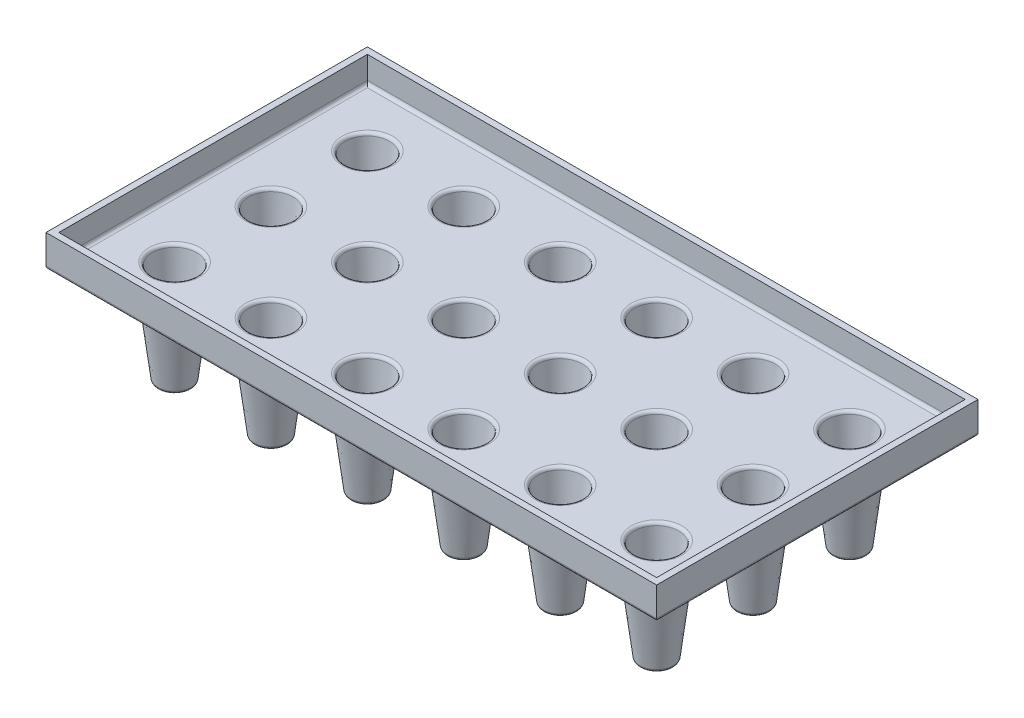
from build123d import *

# Parameters (mm, degrees)
SKETCH1_W                  = 241.3
SKETCH1_H                  = 127
BOSS_EXTRUDE1_DEPTH        = 12.7
SKETCH2_R                  = 12.7
BOSS_EXTRUDE2_DEPTH        = 50.8
BOSS_EXTRUDE2_DRAFT        = -7
LPATTERN1_COPY_1_SKETCH_R  = 12.7
LPATTERN1_COPY_1_DEPTH     = 50.8
LPATTERN1_COPY_1_DRAFT     = -7
LPATTERN1_COPY_2_SKETCH_R  = 12.7
LPATTERN1_COPY_2_DEPTH     = 50.8
LPATTERN1_COPY_2_DRAFT     = -7
LPATTERN1_COPY_3_SKETCH_R  = 12.7
LPATTERN1_COPY_3_DEPTH     = 50.8
LPATTERN1_COPY_3_DRAFT     = -7
LPATTERN1_COPY_4_SKETCH_R  = 12.7
LPATTERN1_COPY_4_DEPTH     = 50.8
LPATTERN1_COPY_4_DRAFT     = -7
LPATTERN1_COPY_5_SKETCH_R  = 12.7
LPATTERN1_COPY_5_DEPTH     = 50.8
LPATTERN1_COPY_5_DRAFT     = -7
LPATTERN1_COPY_6_SKETCH_R  = 12.7
LPATTERN1_COPY_6_DEPTH     = 50.8
LPATTERN1_COPY_6_DRAFT     = -7
LPATTERN1_COPY_7_SKETCH_R  = 12.7
LPATTERN1_COPY_7_DEPTH     = 50.8
LPATTERN1_COPY_7_DRAFT     = -7
LPATTERN1_COPY_8_SKETCH_R  = 12.7
LPATTERN1_COPY_8_DEPTH     = 50.8
LPATTERN1_COPY_8_DRAFT     = -7
LPATTERN1_COPY_9_SKETCH_R  = 12.7
LPATTERN1_COPY_9_DEPTH     = 50.8
LPATTERN1_COPY_9_DRAFT     = -7
LPATTERN1_COPY_10_SKETCH_R = 12.7
LPATTERN1_COPY_10_DEPTH    = 50.8
LPATTERN1_COPY_10_DRAFT    = -7
LPATTERN1_COPY_11_SKETCH_R = 12.7
LPATTERN1_COPY_11_DEPTH    = 50.8
LPATTERN1_COPY_11_DRAFT    = -7
LPATTERN1_COPY_12_SKETCH_R = 12.7
LPATTERN1_COPY_12_DEPTH    = 50.8
LPATTERN1_COPY_12_DRAFT    = -7
LPATTERN1_COPY_13_SKETCH_R = 12.7
LPATTERN1_COPY_13_DEPTH    = 50.8
LPATTERN1_COPY_13_DRAFT    = -7
LPATTERN1_COPY_14_SKETCH_R = 12.7
LPATTERN1_COPY_14_DEPTH    = 50.8
LPATTERN1_COPY_14_DRAFT    = -7
LPATTERN1_COPY_15_SKETCH_R = 12.7
LPATTERN1_COPY_15_DEPTH    = 50.8
LPATTERN1_COPY_15_DRAFT    = -7
LPATTERN1_COPY_16_SKETCH_R = 12.7
LPATTERN1_COPY_16_DEPTH    = 50.8
LPATTERN1_COPY_16_DRAFT    = -7
LPATTERN1_COPY_17_SKETCH_R = 12.7
LPATTERN1_COPY_17_DEPTH    = 50.8
LPATTERN1_COPY_17_DRAFT    = -7
SHELL1_T                   = -2.54
FILLET1_R                  = 1.27


with BuildPart() as part:
    # Sketch1 → Boss-Extrude1 (new body)
    with BuildSketch(Plane(origin=(0, 0, 0), x_dir=(1, 0, 0), z_dir=(0, 1, 0))):
        with Locations((120.65, 63.5)):
            Rectangle(SKETCH1_W, SKETCH1_H)
    extrude(amount=BOSS_EXTRUDE1_DEPTH)


with BuildPart() as boss_extrude2_tool:
    # Sketch2 → Boss-Extrude2 (with draft: the straight prism first)
    with BuildSketch(Plane(origin=(0, 12.7, 0), x_dir=(1, 0, 0), z_dir=(0, 1, 0))):
        with Locations((25.4, 25.4)):
            Circle(SKETCH2_R)
    extrude(amount=-BOSS_EXTRUDE2_DEPTH)
    # Boss-Extrude2: the draft: its side faces are tilted about the plane it starts from
    boss_extrude2_sides = [boss_extrude2_tool.faces().sort_by_distance(p)[0] for p in [
        (12.7, -12.7, -25.4),
    ]]
    draft(boss_extrude2_sides, Plane(origin=(0, 12.7, 0), x_dir=(1, 0, 0), z_dir=(0, 1, 0)), BOSS_EXTRUDE2_DRAFT)


with BuildPart() as part_1:
    add(part.part)

    # Boss-Extrude2: add boss_extrude2_tool
    add(boss_extrude2_tool.part)


with BuildPart() as lpattern1_copy_1_tool:
    # LPattern1 copy 1 sketch → LPattern1 copy 1 (with draft: the straight prism first)
    with BuildSketch(Plane(origin=(0, 12.7, -38.1), x_dir=(1, 0, 0), z_dir=(0, 1, 0))):
        with Locations((25.4, 25.4)):
            Circle(LPATTERN1_COPY_1_SKETCH_R)
    extrude(amount=-LPATTERN1_COPY_1_DEPTH)
    # LPattern1 copy 1: the draft: its side faces are tilted about the plane it starts from
    lpattern1_copy_1_sides = [lpattern1_copy_1_tool.faces().sort_by_distance(p)[0] for p in [
        (12.7, -12.7, -63.5),
    ]]
    draft(lpattern1_copy_1_sides, Plane(origin=(0, 12.7, -38.1), x_dir=(1, 0, 0), z_dir=(0, 1, 0)), LPATTERN1_COPY_1_DRAFT)


with BuildPart() as part_2:
    add(part_1.part)

    # LPattern1 copy 1: add lpattern1_copy_1_tool
    add(lpattern1_copy_1_tool.part)


with BuildPart() as lpattern1_copy_2_tool:
    # LPattern1 copy 2 sketch → LPattern1 copy 2 (with draft: the straight prism first)
    with BuildSketch(Plane(origin=(0, 12.7, -76.2), x_dir=(1, 0, 0), z_dir=(0, 1, 0))):
        with Locations((25.4, 25.4)):
            Circle(LPATTERN1_COPY_2_SKETCH_R)
    extrude(amount=-LPATTERN1_COPY_2_DEPTH)
    # LPattern1 copy 2: the draft: its side faces are tilted about the plane it starts from
    lpattern1_copy_2_sides = [lpattern1_copy_2_tool.faces().sort_by_distance(p)[0] for p in [
        (12.7, -12.7, -101.6),
    ]]
    draft(lpattern1_copy_2_sides, Plane(origin=(0, 12.7, -76.2), x_dir=(1, 0, 0), z_dir=(0, 1, 0)), LPATTERN1_COPY_2_DRAFT)


with BuildPart() as part_3:
    add(part_2.part)

    # LPattern1 copy 2: add lpattern1_copy_2_tool
    add(lpattern1_copy_2_tool.part)


with BuildPart() as lpattern1_copy_3_tool:
    # LPattern1 copy 3 sketch → LPattern1 copy 3 (with draft: the straight prism first)
    with BuildSketch(Plane(origin=(38.1, 12.7, 0), x_dir=(1, 0, 0), z_dir=(0, 1, 0))):
        with Locations((25.4, 25.4)):
            Circle(LPATTERN1_COPY_3_SKETCH_R)
    extrude(amount=-LPATTERN1_COPY_3_DEPTH)
    # LPattern1 copy 3: the draft: its side faces are tilted about the plane it starts from
    lpattern1_copy_3_sides = [lpattern1_copy_3_tool.faces().sort_by_distance(p)[0] for p in [
        (50.8, -12.7, -25.4),
    ]]
    draft(lpattern1_copy_3_sides, Plane(origin=(38.1, 12.7, 0), x_dir=(1, 0, 0), z_dir=(0, 1, 0)), LPATTERN1_COPY_3_DRAFT)


with BuildPart() as part_4:
    add(part_3.part)

    # LPattern1 copy 3: add lpattern1_copy_3_tool
    add(lpattern1_copy_3_tool.part)


with BuildPart() as lpattern1_copy_4_tool:
    # LPattern1 copy 4 sketch → LPattern1 copy 4 (with draft: the straight prism first)
    with BuildSketch(Plane(origin=(38.1, 12.7, -38.1), x_dir=(1, 0, 0), z_dir=(0, 1, 0))):
        with Locations((25.4, 25.4)):
            Circle(LPATTERN1_COPY_4_SKETCH_R)
    extrude(amount=-LPATTERN1_COPY_4_DEPTH)
    # LPattern1 copy 4: the draft: its side faces are tilted about the plane it starts from
    lpattern1_copy_4_sides = [lpattern1_copy_4_tool.faces().sort_by_distance(p)[0] for p in [
        (50.8, -12.7, -63.5),
    ]]
    draft(lpattern1_copy_4_sides, Plane(origin=(38.1, 12.7, -38.1), x_dir=(1, 0, 0), z_dir=(0, 1, 0)), LPATTERN1_COPY_4_DRAFT)


with BuildPart() as part_5:
    add(part_4.part)

    # LPattern1 copy 4: add lpattern1_copy_4_tool
    add(lpattern1_copy_4_tool.part)


with BuildPart() as lpattern1_copy_5_tool:
    # LPattern1 copy 5 sketch → LPattern1 copy 5 (with draft: the straight prism first)
    with BuildSketch(Plane(origin=(38.1, 12.7, -76.2), x_dir=(1, 0, 0), z_dir=(0, 1, 0))):
        with Locations((25.4, 25.4)):
            Circle(LPATTERN1_COPY_5_SKETCH_R)
    extrude(amount=-LPATTERN1_COPY_5_DEPTH)
    # LPattern1 copy 5: the draft: its side faces are tilted about the plane it starts from
    lpattern1_copy_5_sides = [lpattern1_copy_5_tool.faces().sort_by_distance(p)[0] for p in [
        (50.8, -12.7, -101.6),
    ]]
    draft(lpattern1_copy_5_sides, Plane(origin=(38.1, 12.7, -76.2), x_dir=(1, 0, 0), z_dir=(0, 1, 0)), LPATTERN1_COPY_5_DRAFT)


with BuildPart() as part_6:
    add(part_5.part)

    # LPattern1 copy 5: add lpattern1_copy_5_tool
    add(lpattern1_copy_5_tool.part)


with BuildPart() as lpattern1_copy_6_tool:
    # LPattern1 copy 6 sketch → LPattern1 copy 6 (with draft: the straight prism first)
    with BuildSketch(Plane(origin=(76.2, 12.7, 0), x_dir=(1, 0, 0), z_dir=(0, 1, 0))):
        with Locations((25.4, 25.4)):
            Circle(LPATTERN1_COPY_6_SKETCH_R)
    extrude(amount=-LPATTERN1_COPY_6_DEPTH)
    # LPattern1 copy 6: the draft: its side faces are tilted about the plane it starts from
    lpattern1_copy_6_sides = [lpattern1_copy_6_tool.faces().sort_by_distance(p)[0] for p in [
        (88.9, -12.7, -25.4),
    ]]
    draft(lpattern1_copy_6_sides, Plane(origin=(76.2, 12.7, 0), x_dir=(1, 0, 0), z_dir=(0, 1, 0)), LPATTERN1_COPY_6_DRAFT)


with BuildPart() as part_7:
    add(part_6.part)

    # LPattern1 copy 6: add lpattern1_copy_6_tool
    add(lpattern1_copy_6_tool.part)


with BuildPart() as lpattern1_copy_7_tool:
    # LPattern1 copy 7 sketch → LPattern1 copy 7 (with draft: the straight prism first)
    with BuildSketch(Plane(origin=(76.2, 12.7, -38.1), x_dir=(1, 0, 0), z_dir=(0, 1, 0))):
        with Locations((25.4, 25.4)):
            Circle(LPATTERN1_COPY_7_SKETCH_R)
    extrude(amount=-LPATTERN1_COPY_7_DEPTH)
    # LPattern1 copy 7: the draft: its side faces are tilted about the plane it starts from
    lpattern1_copy_7_sides = [lpattern1_copy_7_tool.faces().sort_by_distance(p)[0] for p in [
        (88.9, -12.7, -63.5),
    ]]
    draft(lpattern1_copy_7_sides, Plane(origin=(76.2, 12.7, -38.1), x_dir=(1, 0, 0), z_dir=(0, 1, 0)), LPATTERN1_COPY_7_DRAFT)


with BuildPart() as part_8:
    add(part_7.part)

    # LPattern1 copy 7: add lpattern1_copy_7_tool
    add(lpattern1_copy_7_tool.part)


with BuildPart() as lpattern1_copy_8_tool:
    # LPattern1 copy 8 sketch → LPattern1 copy 8 (with draft: the straight prism first)
    with BuildSketch(Plane(origin=(76.2, 12.7, -76.2), x_dir=(1, 0, 0), z_dir=(0, 1, 0))):
        with Locations((25.4, 25.4)):
            Circle(LPATTERN1_COPY_8_SKETCH_R)
    extrude(amount=-LPATTERN1_COPY_8_DEPTH)
    # LPattern1 copy 8: the draft: its side faces are tilted about the plane it starts from
    lpattern1_copy_8_sides = [lpattern1_copy_8_tool.faces().sort_by_distance(p)[0] for p in [
        (88.9, -12.7, -101.6),
    ]]
    draft(lpattern1_copy_8_sides, Plane(origin=(76.2, 12.7, -76.2), x_dir=(1, 0, 0), z_dir=(0, 1, 0)), LPATTERN1_COPY_8_DRAFT)


with BuildPart() as part_9:
    add(part_8.part)

    # LPattern1 copy 8: add lpattern1_copy_8_tool
    add(lpattern1_copy_8_tool.part)


with BuildPart() as lpattern1_copy_9_tool:
    # LPattern1 copy 9 sketch → LPattern1 copy 9 (with draft: the straight prism first)
    with BuildSketch(Plane(origin=(114.3, 12.7, 0), x_dir=(1, 0, 0), z_dir=(0, 1, 0))):
        with Locations((25.4, 25.4)):
            Circle(LPATTERN1_COPY_9_SKETCH_R)
    extrude(amount=-LPATTERN1_COPY_9_DEPTH)
    # LPattern1 copy 9: the draft: its side faces are tilted about the plane it starts from
    lpattern1_copy_9_sides = [lpattern1_copy_9_tool.faces().sort_by_distance(p)[0] for p in [
        (127, -12.7, -25.4),
    ]]
    draft(lpattern1_copy_9_sides, Plane(origin=(114.3, 12.7, 0), x_dir=(1, 0, 0), z_dir=(0, 1, 0)), LPATTERN1_COPY_9_DRAFT)


with BuildPart() as part_10:
    add(part_9.part)

    # LPattern1 copy 9: add lpattern1_copy_9_tool
    add(lpattern1_copy_9_tool.part)


with BuildPart() as lpattern1_copy_10_tool:
    # LPattern1 copy 10 sketch → LPattern1 copy 10 (with draft: the straight prism first)
    with BuildSketch(Plane(origin=(114.3, 12.7, -38.1), x_dir=(1, 0, 0), z_dir=(0, 1, 0))):
        with Locations((25.4, 25.4)):
            Circle(LPATTERN1_COPY_10_SKETCH_R)
    extrude(amount=-LPATTERN1_COPY_10_DEPTH)
    # LPattern1 copy 10: the draft: its side faces are tilted about the plane it starts from
    lpattern1_copy_10_sides = [lpattern1_copy_10_tool.faces().sort_by_distance(p)[0] for p in [
        (127, -12.7, -63.5),
    ]]
    draft(lpattern1_copy_10_sides, Plane(origin=(114.3, 12.7, -38.1), x_dir=(1, 0, 0), z_dir=(0, 1, 0)), LPATTERN1_COPY_10_DRAFT)


with BuildPart() as part_11:
    add(part_10.part)

    # LPattern1 copy 10: add lpattern1_copy_10_tool
    add(lpattern1_copy_10_tool.part)


with BuildPart() as lpattern1_copy_11_tool:
    # LPattern1 copy 11 sketch → LPattern1 copy 11 (with draft: the straight prism first)
    with BuildSketch(Plane(origin=(114.3, 12.7, -76.2), x_dir=(1, 0, 0), z_dir=(0, 1, 0))):
        with Locations((25.4, 25.4)):
            Circle(LPATTERN1_COPY_11_SKETCH_R)
    extrude(amount=-LPATTERN1_COPY_11_DEPTH)
    # LPattern1 copy 11: the draft: its side faces are tilted about the plane it starts from
    lpattern1_copy_11_sides = [lpattern1_copy_11_tool.faces().sort_by_distance(p)[0] for p in [
        (127, -12.7, -101.6),
    ]]
    draft(lpattern1_copy_11_sides, Plane(origin=(114.3, 12.7, -76.2), x_dir=(1, 0, 0), z_dir=(0, 1, 0)), LPATTERN1_COPY_11_DRAFT)


with BuildPart() as part_12:
    add(part_11.part)

    # LPattern1 copy 11: add lpattern1_copy_11_tool
    add(lpattern1_copy_11_tool.part)


with BuildPart() as lpattern1_copy_12_tool:
    # LPattern1 copy 12 sketch → LPattern1 copy 12 (with draft: the straight prism first)
    with BuildSketch(Plane(origin=(152.4, 12.7, 0), x_dir=(1, 0, 0), z_dir=(0, 1, 0))):
        with Locations((25.4, 25.4)):
            Circle(LPATTERN1_COPY_12_SKETCH_R)
    extrude(amount=-LPATTERN1_COPY_12_DEPTH)
    # LPattern1 copy 12: the draft: its side faces are tilted about the plane it starts from
    lpattern1_copy_12_sides = [lpattern1_copy_12_tool.faces().sort_by_distance(p)[0] for p in [
        (165.1, -12.7, -25.4),
    ]]
    draft(lpattern1_copy_12_sides, Plane(origin=(152.4, 12.7, 0), x_dir=(1, 0, 0), z_dir=(0, 1, 0)), LPATTERN1_COPY_12_DRAFT)


with BuildPart() as part_13:
    add(part_12.part)

    # LPattern1 copy 12: add lpattern1_copy_12_tool
    add(lpattern1_copy_12_tool.part)


with BuildPart() as lpattern1_copy_13_tool:
    # LPattern1 copy 13 sketch → LPattern1 copy 13 (with draft: the straight prism first)
    with BuildSketch(Plane(origin=(152.4, 12.7, -38.1), x_dir=(1, 0, 0), z_dir=(0, 1, 0))):
        with Locations((25.4, 25.4)):
            Circle(LPATTERN1_COPY_13_SKETCH_R)
    extrude(amount=-LPATTERN1_COPY_13_DEPTH)
    # LPattern1 copy 13: the draft: its side faces are tilted about the plane it starts from
    lpattern1_copy_13_sides = [lpattern1_copy_13_tool.faces().sort_by_distance(p)[0] for p in [
        (165.1, -12.7, -63.5),
    ]]
    draft(lpattern1_copy_13_sides, Plane(origin=(152.4, 12.7, -38.1), x_dir=(1, 0, 0), z_dir=(0, 1, 0)), LPATTERN1_COPY_13_DRAFT)


with BuildPart() as part_14:
    add(part_13.part)

    # LPattern1 copy 13: add lpattern1_copy_13_tool
    add(lpattern1_copy_13_tool.part)


with BuildPart() as lpattern1_copy_14_tool:
    # LPattern1 copy 14 sketch → LPattern1 copy 14 (with draft: the straight prism first)
    with BuildSketch(Plane(origin=(152.4, 12.7, -76.2), x_dir=(1, 0, 0), z_dir=(0, 1, 0))):
        with Locations((25.4, 25.4)):
            Circle(LPATTERN1_COPY_14_SKETCH_R)
    extrude(amount=-LPATTERN1_COPY_14_DEPTH)
    # LPattern1 copy 14: the draft: its side faces are tilted about the plane it starts from
    lpattern1_copy_14_sides = [lpattern1_copy_14_tool.faces().sort_by_distance(p)[0] for p in [
        (165.1, -12.7, -101.6),
    ]]
    draft(lpattern1_copy_14_sides, Plane(origin=(152.4, 12.7, -76.2), x_dir=(1, 0, 0), z_dir=(0, 1, 0)), LPATTERN1_COPY_14_DRAFT)


with BuildPart() as part_15:
    add(part_14.part)

    # LPattern1 copy 14: add lpattern1_copy_14_tool
    add(lpattern1_copy_14_tool.part)


with BuildPart() as lpattern1_copy_15_tool:
    # LPattern1 copy 15 sketch → LPattern1 copy 15 (with draft: the straight prism first)
    with BuildSketch(Plane(origin=(190.5, 12.7, 0), x_dir=(1, 0, 0), z_dir=(0, 1, 0))):
        with Locations((25.4, 25.4)):
            Circle(LPATTERN1_COPY_15_SKETCH_R)
    extrude(amount=-LPATTERN1_COPY_15_DEPTH)
    # LPattern1 copy 15: the draft: its side faces are tilted about the plane it starts from
    lpattern1_copy_15_sides = [lpattern1_copy_15_tool.faces().sort_by_distance(p)[0] for p in [
        (203.2, -12.7, -25.4),
    ]]
    draft(lpattern1_copy_15_sides, Plane(origin=(190.5, 12.7, 0), x_dir=(1, 0, 0), z_dir=(0, 1, 0)), LPATTERN1_COPY_15_DRAFT)


with BuildPart() as part_16:
    add(part_15.part)

    # LPattern1 copy 15: add lpattern1_copy_15_tool
    add(lpattern1_copy_15_tool.part)


with BuildPart() as lpattern1_copy_16_tool:
    # LPattern1 copy 16 sketch → LPattern1 copy 16 (with draft: the straight prism first)
    with BuildSketch(Plane(origin=(190.5, 12.7, -38.1), x_dir=(1, 0, 0), z_dir=(0, 1, 0))):
        with Locations((25.4, 25.4)):
            Circle(LPATTERN1_COPY_16_SKETCH_R)
    extrude(amount=-LPATTERN1_COPY_16_DEPTH)
    # LPattern1 copy 16: the draft: its side faces are tilted about the plane it starts from
    lpattern1_copy_16_sides = [lpattern1_copy_16_tool.faces().sort_by_distance(p)[0] for p in [
        (203.2, -12.7, -63.5),
    ]]
    draft(lpattern1_copy_16_sides, Plane(origin=(190.5, 12.7, -38.1), x_dir=(1, 0, 0), z_dir=(0, 1, 0)), LPATTERN1_COPY_16_DRAFT)


with BuildPart() as part_17:
    add(part_16.part)

    # LPattern1 copy 16: add lpattern1_copy_16_tool
    add(lpattern1_copy_16_tool.part)


with BuildPart() as lpattern1_copy_17_tool:
    # LPattern1 copy 17 sketch → LPattern1 copy 17 (with draft: the straight prism first)
    with BuildSketch(Plane(origin=(190.5, 12.7, -76.2), x_dir=(1, 0, 0), z_dir=(0, 1, 0))):
        with Locations((25.4, 25.4)):
            Circle(LPATTERN1_COPY_17_SKETCH_R)
    extrude(amount=-LPATTERN1_COPY_17_DEPTH)
    # LPattern1 copy 17: the draft: its side faces are tilted about the plane it starts from
    lpattern1_copy_17_sides = [lpattern1_copy_17_tool.faces().sort_by_distance(p)[0] for p in [
        (203.2, -12.7, -101.6),
    ]]
    draft(lpattern1_copy_17_sides, Plane(origin=(190.5, 12.7, -76.2), x_dir=(1, 0, 0), z_dir=(0, 1, 0)), LPATTERN1_COPY_17_DRAFT)


with BuildPart() as part_18:
    add(part_17.part)

    # LPattern1 copy 17: add lpattern1_copy_17_tool
    add(lpattern1_copy_17_tool.part)

    # Shell1
    shell1_openings = [part_18.faces().sort_by_distance(p)[0] for p in [
        (120.65, 12.7, -63.5),
    ]]
    offset(amount=SHELL1_T, openings=shell1_openings, kind=Kind.INTERSECTION)

    # Fillet1
    fillet1_edges = [part_18.edges().sort_by_distance(p)[0] for p in [
        (14.259363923, 0, -25.4),
        (18.937455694, -38.1, -25.4),
        (52.359363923, 0, -25.4),
        (57.037455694, -38.1, -25.4),
        (90.459363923, 0, -25.4),
        (95.137455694, -38.1, -25.4),
        (128.559363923, 0, -25.4),
        (133.237455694, -38.1, -25.4),
        (166.659363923, 0, -25.4),
        (171.337455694, -38.1, -25.4),
        (204.759363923, 0, -25.4),
        (209.437455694, -38.1, -25.4),
        (14.259363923, 0, -63.5),
        (18.937455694, -38.1, -63.5),
        (52.359363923, 0, -63.5),
        (57.037455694, -38.1, -63.5),
        (90.459363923, 0, -63.5),
        (95.137455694, -38.1, -63.5),
        (128.559363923, 0, -63.5),
        (133.237455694, -38.1, -63.5),
        (166.659363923, 0, -63.5),
        (171.337455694, -38.1, -63.5),
        (204.759363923, 0, -63.5),
        (209.437455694, -38.1, -63.5),
        (14.259363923, 0, -101.6),
        (18.937455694, -38.1, -101.6),
        (52.359363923, 0, -101.6),
        (57.037455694, -38.1, -101.6),
        (120.65, 0, -127),
        (90.459363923, 0, -101.6),
        (95.137455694, -38.1, -101.6),
        (128.559363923, 0, -101.6),
        (133.237455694, -38.1, -101.6),
        (241.3, 0, -63.5),
        (166.659363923, 0, -101.6),
        (171.337455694, -38.1, -101.6),
        (204.759363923, 0, -101.6),
        (209.437455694, -38.1, -101.6),
        (120.65, 0, 0),
        (0, 0, -63.5),
        (2.54, 2.54, -63.5),
        (120.65, 2.54, -2.54),
        (238.76, 2.54, -63.5),
        (120.65, 2.54, -124.46),
        (16.506566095, 2.54, -25.4),
        (21.184657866, -35.56, -25.4),
        (54.606566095, 2.54, -25.4),
        (59.284657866, -35.56, -25.4),
        (92.706566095, 2.54, -25.4),
        (97.384657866, -35.56, -25.4),
        (130.806566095, 2.54, -25.4),
        (135.484657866, -35.56, -25.4),
        (168.906566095, 2.54, -25.4),
        (173.584657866, -35.56, -25.4),
        (207.006566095, 2.54, -25.4),
        (211.684657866, -35.56, -25.4),
        (16.506566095, 2.54, -63.5),
        (21.184657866, -35.56, -63.5),
        (54.606566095, 2.54, -63.5),
        (59.284657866, -35.56, -63.5),
        (92.706566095, 2.54, -63.5),
        (97.384657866, -35.56, -63.5),
        (130.806566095, 2.54, -63.5),
        (135.484657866, -35.56, -63.5),
        (168.906566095, 2.54, -63.5),
        (173.584657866, -35.56, -63.5),
        (207.006566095, 2.54, -63.5),
        (211.684657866, -35.56, -63.5),
        (16.506566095, 2.54, -101.6),
        (21.184657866, -35.56, -101.6),
        (54.606566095, 2.54, -101.6),
        (59.284657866, -35.56, -101.6),
        (92.706566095, 2.54, -101.6),
        (97.384657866, -35.56, -101.6),
        (130.806566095, 2.54, -101.6),
        (135.484657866, -35.56, -101.6),
        (168.906566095, 2.54, -101.6),
        (173.584657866, -35.56, -101.6),
        (207.006566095, 2.54, -101.6),
        (211.684657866, -35.56, -101.6),
    ]]
    fillet(fillet1_edges, radius=FILLET1_R)


solid = part_18.part
